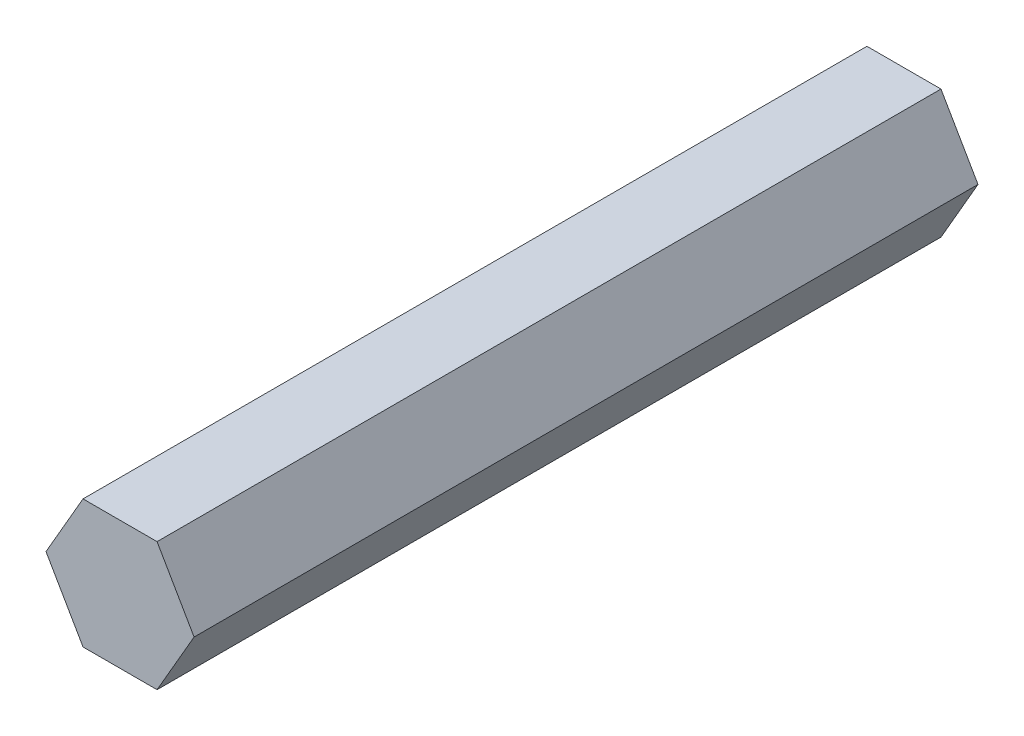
from build123d import *

# Parameters (mm, degrees)
BASE_EXTRUSION_START = -24.45
BASE_EXTRUSION_DEPTH = 24.45


with BuildPart() as part:
    # Esquisse1 → Base-Extrusion (new body)
    with BuildSketch(Plane.XY.offset(BASE_EXTRUSION_START)):
        Polygon((2.309401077, 0), (1.154700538, 2), (-1.154700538, 2), (-2.309401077, 0), (-1.154700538, -2), (1.154700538, -2), align=None)
    extrude(amount=BASE_EXTRUSION_DEPTH)


solid = part.part
